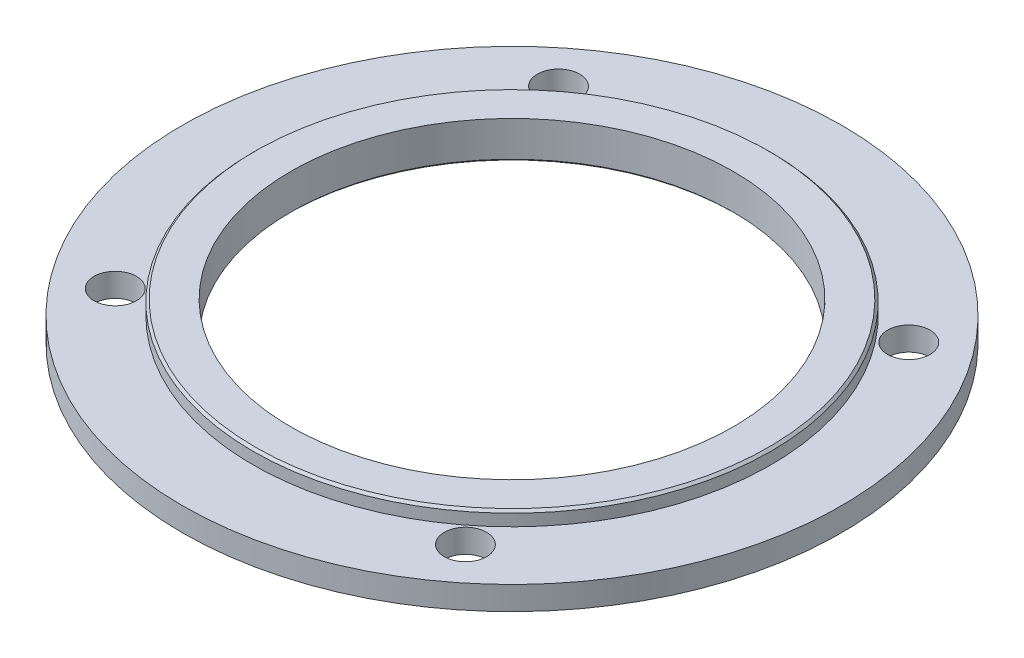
ISO-10303-21;
HEADER;
FILE_DESCRIPTION(('STEP AP214'),'2;1');
FILE_NAME('part.step','',(''),(''),'','','');
FILE_SCHEMA(('AUTOMOTIVE_DESIGN { 1 0 10303 214 1 1 1 1 }'));
ENDSEC;
DATA;
#1=APPLICATION_CONTEXT('core data for automotive mechanical design processes');
#2=APPLICATION_PROTOCOL_DEFINITION('international standard','automotive_design',2000,#1);
#3=PRODUCT_CONTEXT('',#1,'mechanical');
#4=PRODUCT('Part','Part','',(#3));
#5=PRODUCT_RELATED_PRODUCT_CATEGORY('part','',(#4));
#6=PRODUCT_DEFINITION_FORMATION('','',#4);
#7=PRODUCT_DEFINITION_CONTEXT('part definition',#1,'design');
#8=PRODUCT_DEFINITION('design','',#6,#7);
#9=PRODUCT_DEFINITION_SHAPE('','',#8);
#10=(LENGTH_UNIT() NAMED_UNIT(*) SI_UNIT(.MILLI.,.METRE.));
#11=(NAMED_UNIT(*) PLANE_ANGLE_UNIT() SI_UNIT($,.RADIAN.));
#12=(NAMED_UNIT(*) SI_UNIT($,.STERADIAN.) SOLID_ANGLE_UNIT());
#13=UNCERTAINTY_MEASURE_WITH_UNIT(LENGTH_MEASURE(1.E-05),#10,'distance_accuracy_value','');
#14=(GEOMETRIC_REPRESENTATION_CONTEXT(3) GLOBAL_UNCERTAINTY_ASSIGNED_CONTEXT((#13)) GLOBAL_UNIT_ASSIGNED_CONTEXT((#10,
#11,#12)) REPRESENTATION_CONTEXT('',''));
#15=CARTESIAN_POINT('',(0.,0.,0.));
#16=DIRECTION('',(0.,0.,1.));
#17=DIRECTION('',(1.,0.,0.));
#18=AXIS2_PLACEMENT_3D('',#15,#16,#17);
#19=CARTESIAN_POINT('',(70.,0.,0.));
#20=DIRECTION('',(0.,-1.,0.));
#21=DIRECTION('',(0.,0.,-1.));
#22=AXIS2_PLACEMENT_3D('',#19,#20,#21);
#23=PLANE('',#22);
#24=CARTESIAN_POINT('',(-47.0797027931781,0.,37.1954511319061));
#25=DIRECTION('',(0.,-1.,0.));
#26=DIRECTION('',(0.,0.,-1.));
#27=AXIS2_PLACEMENT_3D('',#24,#25,#26);
#28=CIRCLE('',#27,4.49999999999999);
#29=CARTESIAN_POINT('',(-47.0797027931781,0.,32.6954511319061));
#30=VERTEX_POINT('',#29);
#31=EDGE_CURVE('E64',#30,#30,#28,.T.);
#32=ORIENTED_EDGE('',*,*,#31,.F.);
#33=EDGE_LOOP('',(#32));
#34=FACE_BOUND('',#33,.T.);
#35=CARTESIAN_POINT('',(37.195451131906,0.,47.0797027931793));
#36=DIRECTION('',(0.,-1.,0.));
#37=DIRECTION('',(0.,0.,-1.));
#38=AXIS2_PLACEMENT_3D('',#35,#36,#37);
#39=CIRCLE('',#38,4.49999999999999);
#40=CARTESIAN_POINT('',(37.195451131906,0.,42.5797027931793));
#41=VERTEX_POINT('',#40);
#42=EDGE_CURVE('E54',#41,#41,#39,.T.);
#43=ORIENTED_EDGE('',*,*,#42,.F.);
#44=EDGE_LOOP('',(#43));
#45=FACE_BOUND('',#44,.T.);
#46=CARTESIAN_POINT('',(47.0797027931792,0.,-37.1954511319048));
#47=DIRECTION('',(0.,-1.,0.));
#48=DIRECTION('',(0.,0.,-1.));
#49=AXIS2_PLACEMENT_3D('',#46,#47,#48);
#50=CIRCLE('',#49,4.49999999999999);
#51=CARTESIAN_POINT('',(47.0797027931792,0.,-41.6954511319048));
#52=VERTEX_POINT('',#51);
#53=EDGE_CURVE('E51',#52,#52,#50,.T.);
#54=ORIENTED_EDGE('',*,*,#53,.F.);
#55=EDGE_LOOP('',(#54));
#56=FACE_BOUND('',#55,.T.);
#57=CARTESIAN_POINT('',(-37.1954511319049,0.,-47.079702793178));
#58=DIRECTION('',(0.,-1.,0.));
#59=DIRECTION('',(0.,0.,-1.));
#60=AXIS2_PLACEMENT_3D('',#57,#58,#59);
#61=CIRCLE('',#60,4.49999999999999);
#62=CARTESIAN_POINT('',(-37.1954511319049,0.,-51.5797027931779));
#63=VERTEX_POINT('',#62);
#64=EDGE_CURVE('E48',#63,#63,#61,.T.);
#65=ORIENTED_EDGE('',*,*,#64,.F.);
#66=EDGE_LOOP('',(#65));
#67=FACE_BOUND('',#66,.T.);
#68=CARTESIAN_POINT('',(0.,0.,0.));
#69=DIRECTION('',(0.,-1.,0.));
#70=DIRECTION('',(0.,0.,-1.));
#71=AXIS2_PLACEMENT_3D('',#68,#69,#70);
#72=CIRCLE('',#71,47.5);
#73=CARTESIAN_POINT('',(0.,0.,-47.5));
#74=VERTEX_POINT('',#73);
#75=EDGE_CURVE('E40',#74,#74,#72,.F.);
#76=ORIENTED_EDGE('',*,*,#75,.T.);
#77=EDGE_LOOP('',(#76));
#78=FACE_BOUND('',#77,.T.);
#79=CARTESIAN_POINT('',(0.,0.,0.));
#80=DIRECTION('',(0.,-1.,0.));
#81=DIRECTION('',(0.,0.,-1.));
#82=AXIS2_PLACEMENT_3D('',#79,#80,#81);
#83=CIRCLE('',#82,70.);
#84=CARTESIAN_POINT('',(0.,0.,-70.));
#85=VERTEX_POINT('',#84);
#86=EDGE_CURVE('E47',#85,#85,#83,.T.);
#87=ORIENTED_EDGE('',*,*,#86,.T.);
#88=EDGE_LOOP('',(#87));
#89=FACE_BOUND('',#88,.T.);
#90=ADVANCED_FACE('F28',(#34,#45,#56,#67,#78,#89),#23,.T.);
#91=CARTESIAN_POINT('',(0.,0.,0.));
#92=DIRECTION('',(0.,-1.,0.));
#93=DIRECTION('',(0.,0.,-1.));
#94=AXIS2_PLACEMENT_3D('',#91,#92,#93);
#95=CYLINDRICAL_SURFACE('',#94,47.);
#96=CARTESIAN_POINT('',(0.,0.5,0.));
#97=DIRECTION('',(0.,-1.,0.));
#98=DIRECTION('',(0.,0.,-1.));
#99=AXIS2_PLACEMENT_3D('',#96,#97,#98);
#100=CIRCLE('',#99,47.);
#101=CARTESIAN_POINT('',(0.,0.5,-47.));
#102=VERTEX_POINT('',#101);
#103=EDGE_CURVE('E80',#102,#102,#100,.T.);
#104=ORIENTED_EDGE('',*,*,#103,.T.);
#105=EDGE_LOOP('',(#104));
#106=FACE_BOUND('',#105,.T.);
#107=CARTESIAN_POINT('',(0.,8.00000000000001,0.));
#108=DIRECTION('',(0.,-1.,0.));
#109=DIRECTION('',(0.,0.,-1.));
#110=AXIS2_PLACEMENT_3D('',#107,#108,#109);
#111=CIRCLE('',#110,47.);
#112=CARTESIAN_POINT('',(0.,8.00000000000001,-47.));
#113=VERTEX_POINT('',#112);
#114=EDGE_CURVE('E77',#113,#113,#111,.T.);
#115=ORIENTED_EDGE('',*,*,#114,.F.);
#116=EDGE_LOOP('',(#115));
#117=FACE_BOUND('',#116,.T.);
#118=ADVANCED_FACE('F95',(#106,#117),#95,.F.);
#119=CARTESIAN_POINT('',(47.,8.00000000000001,0.));
#120=DIRECTION('',(0.,1.,0.));
#121=DIRECTION('',(0.,0.,1.));
#122=AXIS2_PLACEMENT_3D('',#119,#120,#121);
#123=PLANE('',#122);
#124=CARTESIAN_POINT('',(0.,8.00000000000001,0.));
#125=DIRECTION('',(0.,1.,0.));
#126=DIRECTION('',(0.,0.,1.));
#127=AXIS2_PLACEMENT_3D('',#124,#125,#126);
#128=CIRCLE('',#127,54.5);
#129=CARTESIAN_POINT('',(0.,8.00000000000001,54.5));
#130=VERTEX_POINT('',#129);
#131=EDGE_CURVE('E10',#130,#130,#128,.T.);
#132=ORIENTED_EDGE('',*,*,#131,.T.);
#133=EDGE_LOOP('',(#132));
#134=FACE_BOUND('',#133,.T.);
#135=ORIENTED_EDGE('',*,*,#114,.T.);
#136=EDGE_LOOP('',(#135));
#137=FACE_BOUND('',#136,.T.);
#138=ADVANCED_FACE('F98',(#134,#137),#123,.T.);
#139=CARTESIAN_POINT('',(0.,0.,0.));
#140=DIRECTION('',(0.,-1.,0.));
#141=DIRECTION('',(0.,0.,-1.));
#142=AXIS2_PLACEMENT_3D('',#139,#140,#141);
#143=CYLINDRICAL_SURFACE('',#142,55.);
#144=CARTESIAN_POINT('',(0.,7.50000000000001,0.));
#145=DIRECTION('',(0.,1.,0.));
#146=DIRECTION('',(0.,0.,1.));
#147=AXIS2_PLACEMENT_3D('',#144,#145,#146);
#148=CIRCLE('',#147,55.);
#149=CARTESIAN_POINT('',(0.,7.50000000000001,55.));
#150=VERTEX_POINT('',#149);
#151=EDGE_CURVE('E35',#150,#150,#148,.F.);
#152=ORIENTED_EDGE('',*,*,#151,.T.);
#153=EDGE_LOOP('',(#152));
#154=FACE_BOUND('',#153,.T.);
#155=CARTESIAN_POINT('',(0.,5.00000000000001,0.));
#156=DIRECTION('',(0.,-1.,0.));
#157=DIRECTION('',(0.,0.,-1.));
#158=AXIS2_PLACEMENT_3D('',#155,#156,#157);
#159=CIRCLE('',#158,55.);
#160=CARTESIAN_POINT('',(0.,5.00000000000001,-55.));
#161=VERTEX_POINT('',#160);
#162=EDGE_CURVE('E74',#161,#161,#159,.T.);
#163=ORIENTED_EDGE('',*,*,#162,.F.);
#164=EDGE_LOOP('',(#163));
#165=FACE_BOUND('',#164,.T.);
#166=ADVANCED_FACE('F102',(#154,#165),#143,.T.);
#167=CARTESIAN_POINT('',(55.,5.00000000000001,0.));
#168=DIRECTION('',(0.,1.,0.));
#169=DIRECTION('',(0.,0.,1.));
#170=AXIS2_PLACEMENT_3D('',#167,#168,#169);
#171=PLANE('',#170);
#172=CARTESIAN_POINT('',(-47.0797027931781,5.00000000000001,37.1954511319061));
#173=DIRECTION('',(0.,1.,0.));
#174=DIRECTION('',(0.,0.,1.));
#175=AXIS2_PLACEMENT_3D('',#172,#173,#174);
#176=CIRCLE('',#175,4.49999999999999);
#177=CARTESIAN_POINT('',(-47.0797027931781,5.00000000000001,41.6954511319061));
#178=VERTEX_POINT('',#177);
#179=EDGE_CURVE('E31',#178,#178,#176,.T.);
#180=ORIENTED_EDGE('',*,*,#179,.F.);
#181=EDGE_LOOP('',(#180));
#182=FACE_BOUND('',#181,.T.);
#183=CARTESIAN_POINT('',(37.195451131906,5.00000000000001,47.0797027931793));
#184=DIRECTION('',(0.,1.,0.));
#185=DIRECTION('',(0.,0.,1.));
#186=AXIS2_PLACEMENT_3D('',#183,#184,#185);
#187=CIRCLE('',#186,4.49999999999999);
#188=CARTESIAN_POINT('',(37.195451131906,5.00000000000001,51.5797027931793));
#189=VERTEX_POINT('',#188);
#190=EDGE_CURVE('E52',#189,#189,#187,.T.);
#191=ORIENTED_EDGE('',*,*,#190,.F.);
#192=EDGE_LOOP('',(#191));
#193=FACE_BOUND('',#192,.T.);
#194=CARTESIAN_POINT('',(47.0797027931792,5.00000000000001,-37.1954511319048));
#195=DIRECTION('',(0.,1.,0.));
#196=DIRECTION('',(0.,0.,1.));
#197=AXIS2_PLACEMENT_3D('',#194,#195,#196);
#198=CIRCLE('',#197,4.49999999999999);
#199=CARTESIAN_POINT('',(47.0797027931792,5.00000000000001,-32.6954511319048));
#200=VERTEX_POINT('',#199);
#201=EDGE_CURVE('E49',#200,#200,#198,.T.);
#202=ORIENTED_EDGE('',*,*,#201,.F.);
#203=EDGE_LOOP('',(#202));
#204=FACE_BOUND('',#203,.T.);
#205=CARTESIAN_POINT('',(-37.1954511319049,5.00000000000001,-47.079702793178));
#206=DIRECTION('',(0.,1.,0.));
#207=DIRECTION('',(0.,0.,1.));
#208=AXIS2_PLACEMENT_3D('',#205,#206,#207);
#209=CIRCLE('',#208,4.49999999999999);
#210=CARTESIAN_POINT('',(-37.1954511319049,5.00000000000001,-42.579702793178));
#211=VERTEX_POINT('',#210);
#212=EDGE_CURVE('E44',#211,#211,#209,.T.);
#213=ORIENTED_EDGE('',*,*,#212,.F.);
#214=EDGE_LOOP('',(#213));
#215=FACE_BOUND('',#214,.T.);
#216=ORIENTED_EDGE('',*,*,#162,.T.);
#217=EDGE_LOOP('',(#216));
#218=FACE_BOUND('',#217,.T.);
#219=CARTESIAN_POINT('',(0.,5.,0.));
#220=DIRECTION('',(0.,-1.,0.));
#221=DIRECTION('',(0.,0.,-1.));
#222=AXIS2_PLACEMENT_3D('',#219,#220,#221);
#223=CIRCLE('',#222,70.);
#224=CARTESIAN_POINT('',(0.,5.,-70.));
#225=VERTEX_POINT('',#224);
#226=EDGE_CURVE('E71',#225,#225,#223,.T.);
#227=ORIENTED_EDGE('',*,*,#226,.F.);
#228=EDGE_LOOP('',(#227));
#229=FACE_BOUND('',#228,.T.);
#230=ADVANCED_FACE('F107',(#182,#193,#204,#215,#218,#229),#171,.T.);
#231=CARTESIAN_POINT('',(0.,0.,0.));
#232=DIRECTION('',(0.,-1.,0.));
#233=DIRECTION('',(0.,0.,-1.));
#234=AXIS2_PLACEMENT_3D('',#231,#232,#233);
#235=CYLINDRICAL_SURFACE('',#234,70.);
#236=ORIENTED_EDGE('',*,*,#226,.T.);
#237=EDGE_LOOP('',(#236));
#238=FACE_BOUND('',#237,.T.);
#239=ORIENTED_EDGE('',*,*,#86,.F.);
#240=EDGE_LOOP('',(#239));
#241=FACE_BOUND('',#240,.T.);
#242=ADVANCED_FACE('F91',(#238,#241),#235,.T.);
#243=CARTESIAN_POINT('',(0.,0.5,0.));
#244=DIRECTION('',(0.,-1.,0.));
#245=DIRECTION('',(0.,0.,-1.));
#246=AXIS2_PLACEMENT_3D('',#243,#244,#245);
#247=CONICAL_SURFACE('',#246,47.,0.78539816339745);
#248=ORIENTED_EDGE('',*,*,#75,.F.);
#249=EDGE_LOOP('',(#248));
#250=FACE_BOUND('',#249,.T.);
#251=ORIENTED_EDGE('',*,*,#103,.F.);
#252=EDGE_LOOP('',(#251));
#253=FACE_BOUND('',#252,.T.);
#254=ADVANCED_FACE('F87',(#250,#253),#247,.F.);
#255=CARTESIAN_POINT('',(0.,7.50000000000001,0.));
#256=DIRECTION('',(0.,-1.,0.));
#257=DIRECTION('',(0.,0.,-1.));
#258=AXIS2_PLACEMENT_3D('',#255,#256,#257);
#259=CONICAL_SURFACE('',#258,55.,0.785398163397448);
#260=ORIENTED_EDGE('',*,*,#131,.F.);
#261=EDGE_LOOP('',(#260));
#262=FACE_BOUND('',#261,.T.);
#263=ORIENTED_EDGE('',*,*,#151,.F.);
#264=EDGE_LOOP('',(#263));
#265=FACE_BOUND('',#264,.T.);
#266=ADVANCED_FACE('F90',(#262,#265),#259,.T.);
#267=CARTESIAN_POINT('',(-37.1954511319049,0.,-47.079702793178));
#268=DIRECTION('',(0.,-1.,0.));
#269=DIRECTION('',(0.,0.,-1.));
#270=AXIS2_PLACEMENT_3D('',#267,#268,#269);
#271=CYLINDRICAL_SURFACE('',#270,4.49999999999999);
#272=ORIENTED_EDGE('',*,*,#212,.T.);
#273=EDGE_LOOP('',(#272));
#274=FACE_BOUND('',#273,.T.);
#275=ORIENTED_EDGE('',*,*,#64,.T.);
#276=EDGE_LOOP('',(#275));
#277=FACE_BOUND('',#276,.T.);
#278=ADVANCED_FACE('F122',(#274,#277),#271,.F.);
#279=CARTESIAN_POINT('',(47.0797027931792,0.,-37.1954511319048));
#280=DIRECTION('',(0.,-1.,0.));
#281=DIRECTION('',(0.,0.,-1.));
#282=AXIS2_PLACEMENT_3D('',#279,#280,#281);
#283=CYLINDRICAL_SURFACE('',#282,4.49999999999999);
#284=ORIENTED_EDGE('',*,*,#201,.T.);
#285=EDGE_LOOP('',(#284));
#286=FACE_BOUND('',#285,.T.);
#287=ORIENTED_EDGE('',*,*,#53,.T.);
#288=EDGE_LOOP('',(#287));
#289=FACE_BOUND('',#288,.T.);
#290=ADVANCED_FACE('F124',(#286,#289),#283,.F.);
#291=CARTESIAN_POINT('',(37.195451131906,0.,47.0797027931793));
#292=DIRECTION('',(0.,-1.,0.));
#293=DIRECTION('',(0.,0.,-1.));
#294=AXIS2_PLACEMENT_3D('',#291,#292,#293);
#295=CYLINDRICAL_SURFACE('',#294,4.49999999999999);
#296=ORIENTED_EDGE('',*,*,#190,.T.);
#297=EDGE_LOOP('',(#296));
#298=FACE_BOUND('',#297,.T.);
#299=ORIENTED_EDGE('',*,*,#42,.T.);
#300=EDGE_LOOP('',(#299));
#301=FACE_BOUND('',#300,.T.);
#302=ADVANCED_FACE('F131',(#298,#301),#295,.F.);
#303=CARTESIAN_POINT('',(-47.0797027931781,0.,37.1954511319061));
#304=DIRECTION('',(0.,-1.,0.));
#305=DIRECTION('',(0.,0.,-1.));
#306=AXIS2_PLACEMENT_3D('',#303,#304,#305);
#307=CYLINDRICAL_SURFACE('',#306,4.49999999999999);
#308=ORIENTED_EDGE('',*,*,#179,.T.);
#309=EDGE_LOOP('',(#308));
#310=FACE_BOUND('',#309,.T.);
#311=ORIENTED_EDGE('',*,*,#31,.T.);
#312=EDGE_LOOP('',(#311));
#313=FACE_BOUND('',#312,.T.);
#314=ADVANCED_FACE('F160',(#310,#313),#307,.F.);
#315=CLOSED_SHELL('',(#90,#118,#138,#166,#230,#242,#254,#266,#278,#290,#302,#314));
#316=MANIFOLD_SOLID_BREP('B2',#315);
#317=ADVANCED_BREP_SHAPE_REPRESENTATION('',(#18,#316),#14);
#318=SHAPE_DEFINITION_REPRESENTATION(#9,#317);
ENDSEC;
END-ISO-10303-21;
